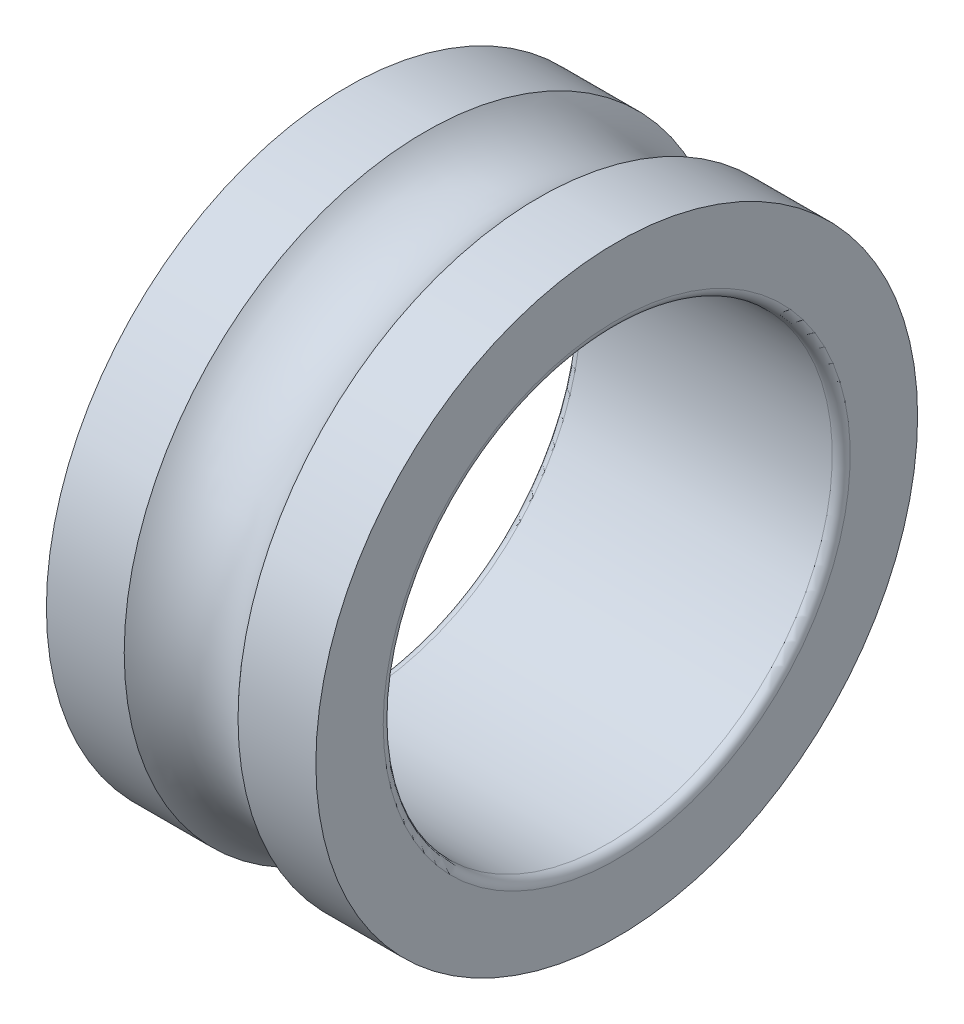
ISO-10303-21;
HEADER;
FILE_DESCRIPTION(('STEP AP214'),'2;1');
FILE_NAME('part.step','',(''),(''),'','','');
FILE_SCHEMA(('AUTOMOTIVE_DESIGN { 1 0 10303 214 1 1 1 1 }'));
ENDSEC;
DATA;
#1=APPLICATION_CONTEXT('core data for automotive mechanical design processes');
#2=APPLICATION_PROTOCOL_DEFINITION('international standard','automotive_design',2000,#1);
#3=PRODUCT_CONTEXT('',#1,'mechanical');
#4=PRODUCT('Part','Part','',(#3));
#5=PRODUCT_RELATED_PRODUCT_CATEGORY('part','',(#4));
#6=PRODUCT_DEFINITION_FORMATION('','',#4);
#7=PRODUCT_DEFINITION_CONTEXT('part definition',#1,'design');
#8=PRODUCT_DEFINITION('design','',#6,#7);
#9=PRODUCT_DEFINITION_SHAPE('','',#8);
#10=(LENGTH_UNIT() NAMED_UNIT(*) SI_UNIT(.MILLI.,.METRE.));
#11=(NAMED_UNIT(*) PLANE_ANGLE_UNIT() SI_UNIT($,.RADIAN.));
#12=(NAMED_UNIT(*) SI_UNIT($,.STERADIAN.) SOLID_ANGLE_UNIT());
#13=UNCERTAINTY_MEASURE_WITH_UNIT(LENGTH_MEASURE(1.E-05),#10,'distance_accuracy_value','');
#14=(GEOMETRIC_REPRESENTATION_CONTEXT(3) GLOBAL_UNCERTAINTY_ASSIGNED_CONTEXT((#13)) GLOBAL_UNIT_ASSIGNED_CONTEXT((#10,
#11,#12)) REPRESENTATION_CONTEXT('',''));
#15=CARTESIAN_POINT('',(0.,0.,0.));
#16=DIRECTION('',(0.,0.,1.));
#17=DIRECTION('',(1.,0.,0.));
#18=AXIS2_PLACEMENT_3D('',#15,#16,#17);
#19=CARTESIAN_POINT('',(0.300000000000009,0.,0.));
#20=DIRECTION('',(-1.,0.,0.));
#21=DIRECTION('',(0.,0.,1.));
#22=AXIS2_PLACEMENT_3D('',#19,#20,#21);
#23=TOROIDAL_SURFACE('',#22,7.8,0.300000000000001);
#24=CARTESIAN_POINT('',(0.300000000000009,0.,0.));
#25=DIRECTION('',(-1.,0.,0.));
#26=DIRECTION('',(0.,0.,1.));
#27=AXIS2_PLACEMENT_3D('',#24,#25,#26);
#28=CIRCLE('',#27,7.5);
#29=CARTESIAN_POINT('',(0.300000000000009,0.,7.5));
#30=VERTEX_POINT('',#29);
#31=EDGE_CURVE('E10',#30,#30,#28,.T.);
#32=ORIENTED_EDGE('',*,*,#31,.F.);
#33=EDGE_LOOP('',(#32));
#34=FACE_BOUND('',#33,.T.);
#35=CARTESIAN_POINT('',(0.,0.,0.));
#36=DIRECTION('',(-1.,0.,0.));
#37=DIRECTION('',(0.,0.,1.));
#38=AXIS2_PLACEMENT_3D('',#35,#36,#37);
#39=CIRCLE('',#38,7.8);
#40=CARTESIAN_POINT('',(0.,0.,7.8));
#41=VERTEX_POINT('',#40);
#42=EDGE_CURVE('E58',#41,#41,#39,.T.);
#43=ORIENTED_EDGE('',*,*,#42,.T.);
#44=EDGE_LOOP('',(#43));
#45=FACE_BOUND('',#44,.T.);
#46=ADVANCED_FACE('F30',(#34,#45),#23,.T.);
#47=CARTESIAN_POINT('',(0.,0.,0.));
#48=DIRECTION('',(-1.,0.,0.));
#49=DIRECTION('',(0.,0.,1.));
#50=AXIS2_PLACEMENT_3D('',#47,#48,#49);
#51=CYLINDRICAL_SURFACE('',#50,7.5);
#52=CARTESIAN_POINT('',(8.70000000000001,0.,0.));
#53=DIRECTION('',(-1.,0.,0.));
#54=DIRECTION('',(0.,0.,1.));
#55=AXIS2_PLACEMENT_3D('',#52,#53,#54);
#56=CIRCLE('',#55,7.5);
#57=CARTESIAN_POINT('',(8.70000000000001,0.,7.50000000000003));
#58=VERTEX_POINT('',#57);
#59=EDGE_CURVE('E36',#58,#58,#56,.T.);
#60=ORIENTED_EDGE('',*,*,#59,.F.);
#61=EDGE_LOOP('',(#60));
#62=FACE_BOUND('',#61,.T.);
#63=ORIENTED_EDGE('',*,*,#31,.T.);
#64=EDGE_LOOP('',(#63));
#65=FACE_BOUND('',#64,.T.);
#66=ADVANCED_FACE('F95',(#62,#65),#51,.F.);
#67=CARTESIAN_POINT('',(8.70000000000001,0.,0.));
#68=DIRECTION('',(-1.,0.,0.));
#69=DIRECTION('',(0.,0.,1.));
#70=AXIS2_PLACEMENT_3D('',#67,#68,#69);
#71=TOROIDAL_SURFACE('',#70,7.8,0.300000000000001);
#72=CARTESIAN_POINT('',(9.00000000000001,0.,0.));
#73=DIRECTION('',(-1.,0.,0.));
#74=DIRECTION('',(0.,0.,1.));
#75=AXIS2_PLACEMENT_3D('',#72,#73,#74);
#76=CIRCLE('',#75,7.8);
#77=CARTESIAN_POINT('',(9.00000000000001,0.,7.80000000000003));
#78=VERTEX_POINT('',#77);
#79=EDGE_CURVE('E40',#78,#78,#76,.T.);
#80=ORIENTED_EDGE('',*,*,#79,.F.);
#81=EDGE_LOOP('',(#80));
#82=FACE_BOUND('',#81,.T.);
#83=ORIENTED_EDGE('',*,*,#59,.T.);
#84=EDGE_LOOP('',(#83));
#85=FACE_BOUND('',#84,.T.);
#86=ADVANCED_FACE('F90',(#82,#85),#71,.T.);
#87=CARTESIAN_POINT('',(9.00000000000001,0.,-10.05));
#88=DIRECTION('',(-1.,0.,0.));
#89=DIRECTION('',(0.,0.,1.));
#90=AXIS2_PLACEMENT_3D('',#87,#88,#89);
#91=PLANE('',#90);
#92=CARTESIAN_POINT('',(9.00000000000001,0.,0.));
#93=DIRECTION('',(-1.,0.,0.));
#94=DIRECTION('',(0.,0.,1.));
#95=AXIS2_PLACEMENT_3D('',#92,#93,#94);
#96=CIRCLE('',#95,10.05);
#97=CARTESIAN_POINT('',(9.00000000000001,0.,10.05));
#98=VERTEX_POINT('',#97);
#99=EDGE_CURVE('E44',#98,#98,#96,.T.);
#100=ORIENTED_EDGE('',*,*,#99,.F.);
#101=EDGE_LOOP('',(#100));
#102=FACE_BOUND('',#101,.T.);
#103=ORIENTED_EDGE('',*,*,#79,.T.);
#104=EDGE_LOOP('',(#103));
#105=FACE_BOUND('',#104,.T.);
#106=ADVANCED_FACE('F84',(#102,#105),#91,.F.);
#107=CARTESIAN_POINT('',(0.,0.,0.));
#108=DIRECTION('',(-1.,0.,0.));
#109=DIRECTION('',(0.,0.,1.));
#110=AXIS2_PLACEMENT_3D('',#107,#108,#109);
#111=CYLINDRICAL_SURFACE('',#110,10.05);
#112=CARTESIAN_POINT('',(6.40065778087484,0.,0.));
#113=DIRECTION('',(-1.,0.,0.));
#114=DIRECTION('',(0.,0.,1.));
#115=AXIS2_PLACEMENT_3D('',#112,#113,#114);
#116=CIRCLE('',#115,10.05);
#117=CARTESIAN_POINT('',(6.40065778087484,0.,10.05));
#118=VERTEX_POINT('',#117);
#119=EDGE_CURVE('E49',#118,#118,#116,.T.);
#120=ORIENTED_EDGE('',*,*,#119,.F.);
#121=EDGE_LOOP('',(#120));
#122=FACE_BOUND('',#121,.T.);
#123=ORIENTED_EDGE('',*,*,#99,.T.);
#124=EDGE_LOOP('',(#123));
#125=FACE_BOUND('',#124,.T.);
#126=ADVANCED_FACE('F78',(#122,#125),#111,.T.);
#127=CARTESIAN_POINT('',(4.50000000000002,0.,0.));
#128=DIRECTION('',(-1.,0.,0.));
#129=DIRECTION('',(0.,0.,1.));
#130=AXIS2_PLACEMENT_3D('',#127,#128,#129);
#131=TOROIDAL_SURFACE('',#130,11.75,2.55);
#132=CARTESIAN_POINT('',(2.59934221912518,0.,0.));
#133=DIRECTION('',(-1.,0.,0.));
#134=DIRECTION('',(0.,0.,1.));
#135=AXIS2_PLACEMENT_3D('',#132,#133,#134);
#136=CIRCLE('',#135,10.05);
#137=CARTESIAN_POINT('',(2.59934221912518,0.,10.05));
#138=VERTEX_POINT('',#137);
#139=EDGE_CURVE('E52',#138,#138,#136,.T.);
#140=ORIENTED_EDGE('',*,*,#139,.F.);
#141=EDGE_LOOP('',(#140));
#142=FACE_BOUND('',#141,.T.);
#143=ORIENTED_EDGE('',*,*,#119,.T.);
#144=EDGE_LOOP('',(#143));
#145=FACE_BOUND('',#144,.T.);
#146=ADVANCED_FACE('F72',(#142,#145),#131,.F.);
#147=CARTESIAN_POINT('',(0.,0.,0.));
#148=DIRECTION('',(-1.,0.,0.));
#149=DIRECTION('',(0.,0.,1.));
#150=AXIS2_PLACEMENT_3D('',#147,#148,#149);
#151=CYLINDRICAL_SURFACE('',#150,10.05);
#152=CARTESIAN_POINT('',(0.,0.,0.));
#153=DIRECTION('',(-1.,0.,0.));
#154=DIRECTION('',(0.,0.,1.));
#155=AXIS2_PLACEMENT_3D('',#152,#153,#154);
#156=CIRCLE('',#155,10.05);
#157=CARTESIAN_POINT('',(0.,0.,10.05));
#158=VERTEX_POINT('',#157);
#159=EDGE_CURVE('E55',#158,#158,#156,.T.);
#160=ORIENTED_EDGE('',*,*,#159,.F.);
#161=EDGE_LOOP('',(#160));
#162=FACE_BOUND('',#161,.T.);
#163=ORIENTED_EDGE('',*,*,#139,.T.);
#164=EDGE_LOOP('',(#163));
#165=FACE_BOUND('',#164,.T.);
#166=ADVANCED_FACE('F66',(#162,#165),#151,.T.);
#167=CARTESIAN_POINT('',(0.,0.,-10.05));
#168=DIRECTION('',(1.,0.,0.));
#169=DIRECTION('',(0.,0.,-1.));
#170=AXIS2_PLACEMENT_3D('',#167,#168,#169);
#171=PLANE('',#170);
#172=ORIENTED_EDGE('',*,*,#42,.F.);
#173=EDGE_LOOP('',(#172));
#174=FACE_BOUND('',#173,.T.);
#175=ORIENTED_EDGE('',*,*,#159,.T.);
#176=EDGE_LOOP('',(#175));
#177=FACE_BOUND('',#176,.T.);
#178=ADVANCED_FACE('F63',(#174,#177),#171,.F.);
#179=CLOSED_SHELL('',(#46,#66,#86,#106,#126,#146,#166,#178));
#180=MANIFOLD_SOLID_BREP('B2',#179);
#181=ADVANCED_BREP_SHAPE_REPRESENTATION('',(#18,#180),#14);
#182=SHAPE_DEFINITION_REPRESENTATION(#9,#181);
ENDSEC;
END-ISO-10303-21;
